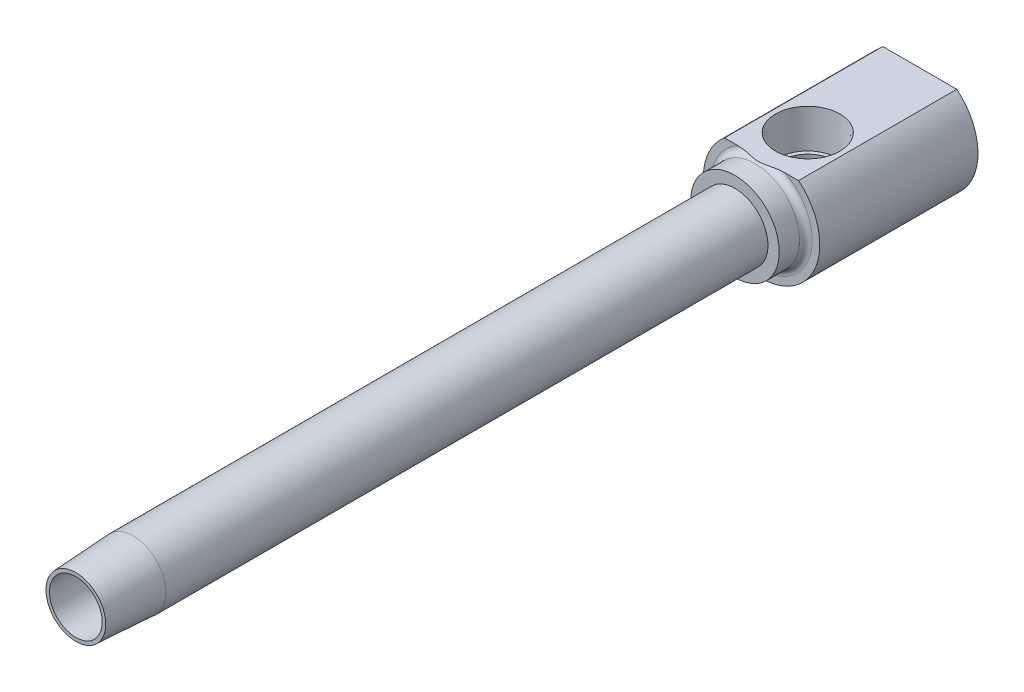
ISO-10303-21;
HEADER;
FILE_DESCRIPTION(('STEP AP214'),'2;1');
FILE_NAME('part.step','',(''),(''),'','','');
FILE_SCHEMA(('AUTOMOTIVE_DESIGN { 1 0 10303 214 1 1 1 1 }'));
ENDSEC;
DATA;
#1=APPLICATION_CONTEXT('core data for automotive mechanical design processes');
#2=APPLICATION_PROTOCOL_DEFINITION('international standard','automotive_design',2000,#1);
#3=PRODUCT_CONTEXT('',#1,'mechanical');
#4=PRODUCT('Part','Part','',(#3));
#5=PRODUCT_RELATED_PRODUCT_CATEGORY('part','',(#4));
#6=PRODUCT_DEFINITION_FORMATION('','',#4);
#7=PRODUCT_DEFINITION_CONTEXT('part definition',#1,'design');
#8=PRODUCT_DEFINITION('design','',#6,#7);
#9=PRODUCT_DEFINITION_SHAPE('','',#8);
#10=(LENGTH_UNIT() NAMED_UNIT(*) SI_UNIT(.MILLI.,.METRE.));
#11=(NAMED_UNIT(*) PLANE_ANGLE_UNIT() SI_UNIT($,.RADIAN.));
#12=(NAMED_UNIT(*) SI_UNIT($,.STERADIAN.) SOLID_ANGLE_UNIT());
#13=UNCERTAINTY_MEASURE_WITH_UNIT(LENGTH_MEASURE(1.E-05),#10,'distance_accuracy_value','');
#14=(GEOMETRIC_REPRESENTATION_CONTEXT(3) GLOBAL_UNCERTAINTY_ASSIGNED_CONTEXT((#13)) GLOBAL_UNIT_ASSIGNED_CONTEXT((#10,
#11,#12)) REPRESENTATION_CONTEXT('',''));
#15=CARTESIAN_POINT('',(0.,0.,0.));
#16=DIRECTION('',(0.,0.,1.));
#17=DIRECTION('',(1.,0.,0.));
#18=AXIS2_PLACEMENT_3D('',#15,#16,#17);
#19=CARTESIAN_POINT('',(0.,0.,-147.434766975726));
#20=DIRECTION('',(0.,0.,-1.));
#21=DIRECTION('',(-1.,0.,0.));
#22=AXIS2_PLACEMENT_3D('',#19,#20,#21);
#23=CYLINDRICAL_SURFACE('',#22,3.9751);
#24=CARTESIAN_POINT('',(0.,0.,-6.8834));
#25=DIRECTION('',(0.,0.,-1.));
#26=DIRECTION('',(-1.,0.,0.));
#27=AXIS2_PLACEMENT_3D('',#24,#25,#26);
#28=CIRCLE('',#27,3.9751);
#29=CARTESIAN_POINT('',(-3.9751,0.,-6.8834));
#30=VERTEX_POINT('',#29);
#31=EDGE_CURVE('E230',#30,#30,#28,.T.);
#32=ORIENTED_EDGE('',*,*,#31,.T.);
#33=EDGE_LOOP('',(#32));
#34=FACE_BOUND('',#33,.T.);
#35=CARTESIAN_POINT('',(0.,0.,-79.3496));
#36=DIRECTION('',(0.,0.,-1.));
#37=DIRECTION('',(-1.,0.,0.));
#38=AXIS2_PLACEMENT_3D('',#35,#36,#37);
#39=CIRCLE('',#38,3.9751);
#40=CARTESIAN_POINT('',(-3.9751,0.,-79.3496));
#41=VERTEX_POINT('',#40);
#42=EDGE_CURVE('E190',#41,#41,#39,.T.);
#43=ORIENTED_EDGE('',*,*,#42,.F.);
#44=EDGE_LOOP('',(#43));
#45=FACE_BOUND('',#44,.T.);
#46=ADVANCED_FACE('F15',(#34,#45),#23,.T.);
#47=CARTESIAN_POINT('',(-3.175,0.,-79.3496));
#48=DIRECTION('',(0.,0.,1.));
#49=DIRECTION('',(1.,0.,0.));
#50=AXIS2_PLACEMENT_3D('',#47,#48,#49);
#51=PLANE('',#50);
#52=CARTESIAN_POINT('',(0.,0.,-79.3496));
#53=DIRECTION('',(0.,0.,-1.));
#54=DIRECTION('',(-1.,0.,0.));
#55=AXIS2_PLACEMENT_3D('',#52,#53,#54);
#56=CIRCLE('',#55,3.175);
#57=CARTESIAN_POINT('',(-3.175,0.,-79.3496));
#58=VERTEX_POINT('',#57);
#59=EDGE_CURVE('E234',#58,#58,#56,.T.);
#60=ORIENTED_EDGE('',*,*,#59,.F.);
#61=EDGE_LOOP('',(#60));
#62=FACE_BOUND('',#61,.T.);
#63=CARTESIAN_POINT('',(0.,-0.206790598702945,-79.3496));
#64=DIRECTION('',(0.,0.,1.));
#65=DIRECTION('',(0.,1.,0.));
#66=AXIS2_PLACEMENT_3D('',#63,#64,#65);
#67=ELLIPSE('',#66,2.91070678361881,2.77750646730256);
#68=CARTESIAN_POINT('',(0.,2.70391618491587,-79.3496));
#69=VERTEX_POINT('',#68);
#70=EDGE_CURVE('E192',#69,#69,#67,.F.);
#71=ORIENTED_EDGE('',*,*,#70,.T.);
#72=EDGE_LOOP('',(#71));
#73=FACE_BOUND('',#72,.T.);
#74=ADVANCED_FACE('F211',(#62,#73),#51,.T.);
#75=CARTESIAN_POINT('',(-3.9751,0.,-79.3496));
#76=DIRECTION('',(0.,0.,1.));
#77=DIRECTION('',(1.,0.,0.));
#78=AXIS2_PLACEMENT_3D('',#75,#76,#77);
#79=PLANE('',#78);
#80=ORIENTED_EDGE('',*,*,#42,.T.);
#81=EDGE_LOOP('',(#80));
#82=FACE_BOUND('',#81,.T.);
#83=CARTESIAN_POINT('',(0.,0.,-79.3496));
#84=DIRECTION('',(0.,0.,-1.));
#85=DIRECTION('',(-1.,0.,0.));
#86=AXIS2_PLACEMENT_3D('',#83,#84,#85);
#87=CIRCLE('',#86,5.334);
#88=CARTESIAN_POINT('',(-5.334,0.,-79.3496));
#89=VERTEX_POINT('',#88);
#90=EDGE_CURVE('E252',#89,#89,#87,.T.);
#91=ORIENTED_EDGE('',*,*,#90,.F.);
#92=EDGE_LOOP('',(#91));
#93=FACE_BOUND('',#92,.T.);
#94=ADVANCED_FACE('F214',(#82,#93),#79,.T.);
#95=CARTESIAN_POINT('',(-3.175,0.,0.));
#96=DIRECTION('',(0.,0.,1.));
#97=DIRECTION('',(1.,0.,0.));
#98=AXIS2_PLACEMENT_3D('',#95,#96,#97);
#99=PLANE('',#98);
#100=CARTESIAN_POINT('',(0.,0.,0.));
#101=DIRECTION('',(0.,0.,-1.));
#102=DIRECTION('',(-1.,0.,0.));
#103=AXIS2_PLACEMENT_3D('',#100,#101,#102);
#104=CIRCLE('',#103,3.5941);
#105=CARTESIAN_POINT('',(-3.5941,0.,0.));
#106=VERTEX_POINT('',#105);
#107=EDGE_CURVE('E508',#106,#106,#104,.T.);
#108=ORIENTED_EDGE('',*,*,#107,.F.);
#109=EDGE_LOOP('',(#108));
#110=FACE_BOUND('',#109,.T.);
#111=CARTESIAN_POINT('',(0.,0.,0.));
#112=DIRECTION('',(0.,0.,-1.));
#113=DIRECTION('',(-1.,0.,0.));
#114=AXIS2_PLACEMENT_3D('',#111,#112,#113);
#115=CIRCLE('',#114,3.175);
#116=CARTESIAN_POINT('',(-3.175,0.,0.));
#117=VERTEX_POINT('',#116);
#118=EDGE_CURVE('E19',#117,#117,#115,.T.);
#119=ORIENTED_EDGE('',*,*,#118,.T.);
#120=EDGE_LOOP('',(#119));
#121=FACE_BOUND('',#120,.T.);
#122=ADVANCED_FACE('F17',(#110,#121),#99,.T.);
#123=CARTESIAN_POINT('',(0.,0.,-147.434766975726));
#124=DIRECTION('',(0.,0.,-1.));
#125=DIRECTION('',(-1.,0.,0.));
#126=AXIS2_PLACEMENT_3D('',#123,#124,#125);
#127=CYLINDRICAL_SURFACE('',#126,3.175);
#128=ORIENTED_EDGE('',*,*,#59,.T.);
#129=EDGE_LOOP('',(#128));
#130=FACE_BOUND('',#129,.T.);
#131=ORIENTED_EDGE('',*,*,#118,.F.);
#132=EDGE_LOOP('',(#131));
#133=FACE_BOUND('',#132,.T.);
#134=ADVANCED_FACE('F209',(#130,#133),#127,.F.);
#135=CARTESIAN_POINT('',(-7.0104,0.,-101.6));
#136=DIRECTION('',(0.,0.,-1.));
#137=DIRECTION('',(-1.,0.,0.));
#138=AXIS2_PLACEMENT_3D('',#135,#136,#137);
#139=PLANE('',#138);
#140=DIRECTION('',(1.,0.,0.));
#141=VECTOR('',#140,1.);
#142=CARTESIAN_POINT('',(-1.83308710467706,3.175,-101.6));
#143=LINE('',#142,#141);
#144=CARTESIAN_POINT('',(-1.83308710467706,3.175,-101.6));
#145=VERTEX_POINT('',#144);
#146=CARTESIAN_POINT('',(1.83308710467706,3.175,-101.6));
#147=VERTEX_POINT('',#146);
#148=EDGE_CURVE('E37',#145,#147,#143,.T.);
#149=ORIENTED_EDGE('',*,*,#148,.F.);
#150=DIRECTION('',(0.5,0.866025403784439,0.));
#151=VECTOR('',#150,1.);
#152=CARTESIAN_POINT('',(-3.66617420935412,0.,-101.6));
#153=LINE('',#152,#151);
#154=CARTESIAN_POINT('',(-3.66617420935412,0.,-101.6));
#155=VERTEX_POINT('',#154);
#156=EDGE_CURVE('E278',#155,#145,#153,.T.);
#157=ORIENTED_EDGE('',*,*,#156,.F.);
#158=DIRECTION('',(-0.5,0.866025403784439,0.));
#159=VECTOR('',#158,1.);
#160=CARTESIAN_POINT('',(-1.83308710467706,-3.175,-101.6));
#161=LINE('',#160,#159);
#162=CARTESIAN_POINT('',(-1.83308710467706,-3.175,-101.6));
#163=VERTEX_POINT('',#162);
#164=EDGE_CURVE('E282',#163,#155,#161,.T.);
#165=ORIENTED_EDGE('',*,*,#164,.F.);
#166=DIRECTION('',(-1.,0.,0.));
#167=VECTOR('',#166,1.);
#168=CARTESIAN_POINT('',(1.83308710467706,-3.175,-101.6));
#169=LINE('',#168,#167);
#170=CARTESIAN_POINT('',(1.83308710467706,-3.175,-101.6));
#171=VERTEX_POINT('',#170);
#172=EDGE_CURVE('E285',#171,#163,#169,.T.);
#173=ORIENTED_EDGE('',*,*,#172,.F.);
#174=DIRECTION('',(-0.5,-0.866025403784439,0.));
#175=VECTOR('',#174,1.);
#176=CARTESIAN_POINT('',(3.66617420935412,0.,-101.6));
#177=LINE('',#176,#175);
#178=CARTESIAN_POINT('',(3.66617420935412,0.,-101.6));
#179=VERTEX_POINT('',#178);
#180=EDGE_CURVE('E288',#179,#171,#177,.T.);
#181=ORIENTED_EDGE('',*,*,#180,.F.);
#182=DIRECTION('',(0.5,-0.866025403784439,0.));
#183=VECTOR('',#182,1.);
#184=CARTESIAN_POINT('',(1.83308710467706,3.175,-101.6));
#185=LINE('',#184,#183);
#186=EDGE_CURVE('E291',#147,#179,#185,.T.);
#187=ORIENTED_EDGE('',*,*,#186,.F.);
#188=EDGE_LOOP('',(#149,#157,#165,#173,#181,#187));
#189=FACE_BOUND('',#188,.T.);
#190=DIRECTION('',(-1.,0.,0.));
#191=VECTOR('',#190,1.);
#192=CARTESIAN_POINT('',(-4.4577,5.41060244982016,-101.6));
#193=LINE('',#192,#191);
#194=CARTESIAN_POINT('',(4.4577,5.41060244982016,-101.6));
#195=VERTEX_POINT('',#194);
#196=CARTESIAN_POINT('',(-4.4577,5.41060244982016,-101.6));
#197=VERTEX_POINT('',#196);
#198=EDGE_CURVE('E261',#195,#197,#193,.T.);
#199=ORIENTED_EDGE('',*,*,#198,.F.);
#200=CARTESIAN_POINT('',(0.,0.,-101.6));
#201=DIRECTION('',(0.,0.,-1.));
#202=DIRECTION('',(-1.,0.,0.));
#203=AXIS2_PLACEMENT_3D('',#200,#201,#202);
#204=CIRCLE('',#203,7.0104);
#205=EDGE_CURVE('E238',#195,#197,#204,.T.);
#206=ORIENTED_EDGE('',*,*,#205,.T.);
#207=EDGE_LOOP('',(#199,#206));
#208=FACE_BOUND('',#207,.T.);
#209=ADVANCED_FACE('F205',(#189,#208),#139,.T.);
#210=CARTESIAN_POINT('',(0.,0.,-147.434766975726));
#211=DIRECTION('',(0.,0.,-1.));
#212=DIRECTION('',(-1.,0.,0.));
#213=AXIS2_PLACEMENT_3D('',#210,#211,#212);
#214=CYLINDRICAL_SURFACE('',#213,7.0104);
#215=DIRECTION('',(0.,0.,-1.));
#216=VECTOR('',#215,1.);
#217=CARTESIAN_POINT('',(-4.4577,5.41060244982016,-72.2376));
#218=LINE('',#217,#216);
#219=CARTESIAN_POINT('',(-4.4577,5.41060244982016,-82.55));
#220=VERTEX_POINT('',#219);
#221=EDGE_CURVE('E258',#220,#197,#218,.T.);
#222=ORIENTED_EDGE('',*,*,#221,.T.);
#223=ORIENTED_EDGE('',*,*,#205,.F.);
#224=DIRECTION('',(0.,0.,-1.));
#225=VECTOR('',#224,1.);
#226=CARTESIAN_POINT('',(4.4577,5.41060244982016,-72.2376));
#227=LINE('',#226,#225);
#228=CARTESIAN_POINT('',(4.4577,5.41060244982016,-82.55));
#229=VERTEX_POINT('',#228);
#230=EDGE_CURVE('E259',#229,#195,#227,.T.);
#231=ORIENTED_EDGE('',*,*,#230,.F.);
#232=CARTESIAN_POINT('',(0.,0.,-82.55));
#233=DIRECTION('',(0.,0.,-1.));
#234=DIRECTION('',(-1.,0.,0.));
#235=AXIS2_PLACEMENT_3D('',#232,#233,#234);
#236=CIRCLE('',#235,7.0104);
#237=EDGE_CURVE('E241',#229,#220,#236,.T.);
#238=ORIENTED_EDGE('',*,*,#237,.T.);
#239=EDGE_LOOP('',(#222,#223,#231,#238));
#240=FACE_BOUND('',#239,.T.);
#241=ADVANCED_FACE('F201',(#240),#214,.T.);
#242=CARTESIAN_POINT('',(-6.096,0.,-82.55));
#243=DIRECTION('',(0.,0.,1.));
#244=DIRECTION('',(1.,0.,0.));
#245=AXIS2_PLACEMENT_3D('',#242,#243,#244);
#246=PLANE('',#245);
#247=DIRECTION('',(1.,0.,0.));
#248=VECTOR('',#247,1.);
#249=CARTESIAN_POINT('',(-6.096,5.41060244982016,-82.55));
#250=LINE('',#249,#248);
#251=CARTESIAN_POINT('',(-2.80830858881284,5.41060244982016,-82.55));
#252=VERTEX_POINT('',#251);
#253=EDGE_CURVE('E255',#220,#252,#250,.T.);
#254=ORIENTED_EDGE('',*,*,#253,.F.);
#255=ORIENTED_EDGE('',*,*,#237,.F.);
#256=CARTESIAN_POINT('',(2.80830858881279,5.41060244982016,-82.55));
#257=VERTEX_POINT('',#256);
#258=EDGE_CURVE('E256',#257,#229,#250,.T.);
#259=ORIENTED_EDGE('',*,*,#258,.F.);
#260=CARTESIAN_POINT('',(0.,0.,-82.55));
#261=DIRECTION('',(0.,0.,-1.));
#262=DIRECTION('',(-1.,0.,0.));
#263=AXIS2_PLACEMENT_3D('',#260,#261,#262);
#264=CIRCLE('',#263,6.096);
#265=EDGE_CURVE('E246',#257,#252,#264,.T.);
#266=ORIENTED_EDGE('',*,*,#265,.T.);
#267=EDGE_LOOP('',(#254,#255,#259,#266));
#268=FACE_BOUND('',#267,.T.);
#269=ADVANCED_FACE('F197',(#268),#246,.T.);
#270=CARTESIAN_POINT('',(0.,0.,-81.788));
#271=DIRECTION('',(0.,0.,-1.));
#272=DIRECTION('',(-1.,0.,0.));
#273=AXIS2_PLACEMENT_3D('',#270,#271,#272);
#274=TOROIDAL_SURFACE('',#273,6.096,0.762);
#275=CARTESIAN_POINT('',(0.,5.41060244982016,-82.1209777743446));
#276=CARTESIAN_POINT('',(0.0521470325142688,5.41060244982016,-82.1209662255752));
#277=CARTESIAN_POINT('',(0.104287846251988,5.41060244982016,-82.1225421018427));
#278=CARTESIAN_POINT('',(0.208401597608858,5.41060244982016,-82.1286316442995));
#279=CARTESIAN_POINT('',(0.260374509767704,5.41060244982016,-82.1331457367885));
#280=CARTESIAN_POINT('',(0.416241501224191,5.41060244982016,-82.1504483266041));
#281=CARTESIAN_POINT('',(0.519704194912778,5.41060244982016,-82.1669914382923));
#282=CARTESIAN_POINT('',(0.726918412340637,5.41060244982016,-82.2056198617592));
#283=CARTESIAN_POINT('',(0.830655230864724,5.41060244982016,-82.2277764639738));
#284=CARTESIAN_POINT('',(1.03759009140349,5.41060244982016,-82.2738404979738));
#285=CARTESIAN_POINT('',(1.14078865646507,5.41060244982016,-82.2977456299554));
#286=CARTESIAN_POINT('',(1.34834228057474,5.41060244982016,-82.3452053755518));
#287=CARTESIAN_POINT('',(1.4526986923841,5.41060244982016,-82.3687541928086));
#288=CARTESIAN_POINT('',(1.6619797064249,5.41060244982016,-82.413460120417));
#289=CARTESIAN_POINT('',(1.76690452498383,5.41060244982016,-82.4346162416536));
#290=CARTESIAN_POINT('',(1.97693672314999,5.41060244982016,-82.4728529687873));
#291=CARTESIAN_POINT('',(2.08204009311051,5.41060244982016,-82.4899548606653));
#292=CARTESIAN_POINT('',(2.29298648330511,5.41060244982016,-82.5186452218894));
#293=CARTESIAN_POINT('',(2.39882937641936,5.41060244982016,-82.5302346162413));
#294=CARTESIAN_POINT('',(2.63825679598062,5.41060244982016,-82.5481707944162));
#295=CARTESIAN_POINT('',(2.77203238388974,5.41060244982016,-82.5524268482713));
#296=CARTESIAN_POINT('',(2.97236053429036,5.41060244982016,-82.5467542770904));
#297=CARTESIAN_POINT('',(3.03908464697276,5.41060244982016,-82.5428533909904));
#298=CARTESIAN_POINT('',(3.17206397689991,5.41060244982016,-82.530250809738));
#299=CARTESIAN_POINT('',(3.2383194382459,5.41060244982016,-82.5215518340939));
#300=CARTESIAN_POINT('',(3.37725624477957,5.41060244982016,-82.49711512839));
#301=CARTESIAN_POINT('',(3.44982215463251,5.41060244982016,-82.48069575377));
#302=CARTESIAN_POINT('',(3.59245961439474,5.41060244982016,-82.4390714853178));
#303=CARTESIAN_POINT('',(3.66253326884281,5.41060244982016,-82.4138742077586));
#304=CARTESIAN_POINT('',(3.77900159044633,5.41060244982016,-82.3610231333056));
#305=CARTESIAN_POINT('',(3.82657256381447,5.41060244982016,-82.3359897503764));
#306=CARTESIAN_POINT('',(3.91754959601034,5.41060244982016,-82.279184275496));
#307=CARTESIAN_POINT('',(3.96096325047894,5.41060244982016,-82.2474248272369));
#308=CARTESIAN_POINT('',(4.02798010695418,5.41060244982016,-82.18789070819));
#309=CARTESIAN_POINT('',(4.05342428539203,5.41060244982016,-82.1621989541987));
#310=CARTESIAN_POINT('',(4.10009948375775,5.41060244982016,-82.1072158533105));
#311=CARTESIAN_POINT('',(4.12133630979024,5.41060244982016,-82.0779295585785));
#312=CARTESIAN_POINT('',(4.15466127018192,5.41060244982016,-82.0218876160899));
#313=CARTESIAN_POINT('',(4.16772173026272,5.41060244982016,-81.995714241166));
#314=CARTESIAN_POINT('',(4.18933719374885,5.41060244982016,-81.941556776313));
#315=CARTESIAN_POINT('',(4.19789541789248,5.41060244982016,-81.9135739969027));
#316=CARTESIAN_POINT('',(4.20987180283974,5.41060244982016,-81.8563342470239));
#317=CARTESIAN_POINT('',(4.21325884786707,5.41060244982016,-81.827070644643));
#318=CARTESIAN_POINT('',(4.21447858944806,5.41060244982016,-81.7684289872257));
#319=CARTESIAN_POINT('',(4.21231242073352,5.41060244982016,-81.7390509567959));
#320=CARTESIAN_POINT('',(4.20309810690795,5.41060244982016,-81.683964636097));
#321=CARTESIAN_POINT('',(4.19653350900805,5.41060244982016,-81.6581729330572));
#322=CARTESIAN_POINT('',(4.17948851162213,5.41060244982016,-81.6079301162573));
#323=CARTESIAN_POINT('',(4.16900680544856,5.41060244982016,-81.5834794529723));
#324=CARTESIAN_POINT('',(4.14035818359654,5.41060244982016,-81.5278520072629));
#325=CARTESIAN_POINT('',(4.12078333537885,5.41060244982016,-81.4974012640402));
#326=CARTESIAN_POINT('',(4.07697861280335,5.41060244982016,-81.4400600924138));
#327=CARTESIAN_POINT('',(4.05273917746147,5.41060244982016,-81.4131771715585));
#328=CARTESIAN_POINT('',(3.98868725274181,5.41060244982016,-81.3511561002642));
#329=CARTESIAN_POINT('',(3.94690497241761,5.41060244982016,-81.318064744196));
#330=CARTESIAN_POINT('',(3.8587952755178,5.41060244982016,-81.2586936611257));
#331=CARTESIAN_POINT('',(3.81245915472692,5.41060244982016,-81.2324273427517));
#332=CARTESIAN_POINT('',(3.7245267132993,5.41060244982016,-81.1894458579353));
#333=CARTESIAN_POINT('',(3.68333828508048,5.41060244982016,-81.1718773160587));
#334=CARTESIAN_POINT('',(3.59958587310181,5.41060244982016,-81.1403604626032));
#335=CARTESIAN_POINT('',(3.55702092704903,5.41060244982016,-81.1264147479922));
#336=CARTESIAN_POINT('',(3.42786902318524,5.41060244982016,-81.0892902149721));
#337=CARTESIAN_POINT('',(3.33991210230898,5.41060244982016,-81.070863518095));
#338=CARTESIAN_POINT('',(3.16528158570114,5.41060244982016,-81.0442403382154));
#339=CARTESIAN_POINT('',(3.07864723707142,5.41060244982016,-81.0357567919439));
#340=CARTESIAN_POINT('',(2.90489485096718,5.41060244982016,-81.0261313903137));
#341=CARTESIAN_POINT('',(2.8177763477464,5.41060244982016,-81.0249986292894));
#342=CARTESIAN_POINT('',(2.64327811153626,5.41060244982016,-81.0286504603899));
#343=CARTESIAN_POINT('',(2.55589913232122,5.41060244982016,-81.0334634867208));
#344=CARTESIAN_POINT('',(2.38166962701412,5.41060244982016,-81.0478649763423));
#345=CARTESIAN_POINT('',(2.29481855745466,5.41060244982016,-81.0574471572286));
#346=CARTESIAN_POINT('',(2.01384766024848,5.41060244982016,-81.0946709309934));
#347=CARTESIAN_POINT('',(1.82076533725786,5.41060244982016,-81.1299456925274));
#348=CARTESIAN_POINT('',(1.53229430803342,5.41060244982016,-81.1898846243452));
#349=CARTESIAN_POINT('',(1.43609183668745,5.41060244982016,-81.2110969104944));
#350=CARTESIAN_POINT('',(1.24390982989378,5.41060244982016,-81.2545341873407));
#351=CARTESIAN_POINT('',(1.14793028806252,5.41060244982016,-81.2767591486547));
#352=CARTESIAN_POINT('',(0.957697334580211,5.41060244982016,-81.3200933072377));
#353=CARTESIAN_POINT('',(0.863446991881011,5.41060244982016,-81.3412158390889));
#354=CARTESIAN_POINT('',(0.674290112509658,5.41060244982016,-81.3805444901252));
#355=CARTESIAN_POINT('',(0.579383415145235,5.41060244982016,-81.3987498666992));
#356=CARTESIAN_POINT('',(0.389272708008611,5.41060244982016,-81.4287534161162));
#357=CARTESIAN_POINT('',(0.294077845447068,5.41060244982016,-81.4406039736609));
#358=CARTESIAN_POINT('',(0.150791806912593,5.41060244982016,-81.4511395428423));
#359=CARTESIAN_POINT('',(0.102969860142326,5.41060244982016,-81.453445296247));
#360=CARTESIAN_POINT('',(0.00727423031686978,5.41060244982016,-81.4554444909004));
#361=CARTESIAN_POINT('',(-0.0405994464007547,5.41060244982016,-81.4551382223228));
#362=CARTESIAN_POINT('',(-0.136934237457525,5.41060244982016,-81.4519171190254));
#363=CARTESIAN_POINT('',(-0.185394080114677,5.41060244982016,-81.4489654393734));
#364=CARTESIAN_POINT('',(-0.282118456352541,5.41060244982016,-81.4406895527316));
#365=CARTESIAN_POINT('',(-0.330382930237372,5.41060244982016,-81.4353646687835));
#366=CARTESIAN_POINT('',(-0.475151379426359,5.41060244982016,-81.4164493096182));
#367=CARTESIAN_POINT('',(-0.571263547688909,5.41060244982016,-81.3999364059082));
#368=CARTESIAN_POINT('',(-0.764047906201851,5.41060244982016,-81.3625658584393));
#369=CARTESIAN_POINT('',(-0.860707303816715,5.41060244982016,-81.3416474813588));
#370=CARTESIAN_POINT('',(-1.05357295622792,5.41060244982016,-81.2984599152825));
#371=CARTESIAN_POINT('',(-1.1497796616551,5.41060244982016,-81.2761927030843));
#372=CARTESIAN_POINT('',(-1.36433899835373,5.41060244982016,-81.2271440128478));
#373=CARTESIAN_POINT('',(-1.48272280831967,5.41060244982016,-81.2004952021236));
#374=CARTESIAN_POINT('',(-1.72029970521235,5.41060244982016,-81.1505730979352));
#375=CARTESIAN_POINT('',(-1.83949323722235,5.41060244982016,-81.1273018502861));
#376=CARTESIAN_POINT('',(-2.07789765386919,5.41060244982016,-81.0865910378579));
#377=CARTESIAN_POINT('',(-2.19710038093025,5.41060244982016,-81.0691052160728));
#378=CARTESIAN_POINT('',(-2.43636519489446,5.41060244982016,-81.0420638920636));
#379=CARTESIAN_POINT('',(-2.55642644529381,5.41060244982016,-81.0325015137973));
#380=CARTESIAN_POINT('',(-2.76780194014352,5.41060244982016,-81.0251640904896));
#381=CARTESIAN_POINT('',(-2.85902659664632,5.41060244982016,-81.0250928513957));
#382=CARTESIAN_POINT('',(-3.04144991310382,5.41060244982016,-81.0327518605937));
#383=CARTESIAN_POINT('',(-3.13264774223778,5.41060244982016,-81.0405045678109));
#384=CARTESIAN_POINT('',(-3.31458996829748,5.41060244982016,-81.0660861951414));
#385=CARTESIAN_POINT('',(-3.40532344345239,5.41060244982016,-81.0840025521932));
#386=CARTESIAN_POINT('',(-3.53857286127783,5.41060244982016,-81.1206989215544));
#387=CARTESIAN_POINT('',(-3.58245316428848,5.41060244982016,-81.1345411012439));
#388=CARTESIAN_POINT('',(-3.6688305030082,5.41060244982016,-81.1659851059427));
#389=CARTESIAN_POINT('',(-3.71132868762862,5.41060244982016,-81.1835837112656));
#390=CARTESIAN_POINT('',(-3.79234387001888,5.41060244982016,-81.2221781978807));
#391=CARTESIAN_POINT('',(-3.83095410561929,5.41060244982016,-81.2429757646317));
#392=CARTESIAN_POINT('',(-3.90549335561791,5.41060244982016,-81.2890810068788));
#393=CARTESIAN_POINT('',(-3.94141935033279,5.41060244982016,-81.3143936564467));
#394=CARTESIAN_POINT('',(-4.00964525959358,5.41060244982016,-81.3703927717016));
#395=CARTESIAN_POINT('',(-4.04189445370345,5.41060244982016,-81.4011422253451));
#396=CARTESIAN_POINT('',(-4.10014383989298,5.41060244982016,-81.4680849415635));
#397=CARTESIAN_POINT('',(-4.12616464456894,5.41060244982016,-81.5042595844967));
#398=CARTESIAN_POINT('',(-4.16162371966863,5.41060244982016,-81.5677603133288));
#399=CARTESIAN_POINT('',(-4.17366550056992,5.41060244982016,-81.5936338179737));
#400=CARTESIAN_POINT('',(-4.19334521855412,5.41060244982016,-81.6470140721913));
#401=CARTESIAN_POINT('',(-4.20098675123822,5.41060244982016,-81.6745194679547));
#402=CARTESIAN_POINT('',(-4.21130602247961,5.41060244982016,-81.7306094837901));
#403=CARTESIAN_POINT('',(-4.21395773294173,5.41060244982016,-81.7591989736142));
#404=CARTESIAN_POINT('',(-4.21398264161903,5.41060244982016,-81.8163806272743));
#405=CARTESIAN_POINT('',(-4.21135613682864,5.41060244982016,-81.8449727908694));
#406=CARTESIAN_POINT('',(-4.20143815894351,5.41060244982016,-81.8991597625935));
#407=CARTESIAN_POINT('',(-4.1945008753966,5.41060244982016,-81.9248210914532));
#408=CARTESIAN_POINT('',(-4.17676949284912,5.41060244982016,-81.9747618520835));
#409=CARTESIAN_POINT('',(-4.1659739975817,5.41060244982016,-81.9990407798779));
#410=CARTESIAN_POINT('',(-4.13643456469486,5.41060244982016,-82.0546640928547));
#411=CARTESIAN_POINT('',(-4.11622825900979,5.41060244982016,-82.0852311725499));
#412=CARTESIAN_POINT('',(-4.0711573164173,5.41060244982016,-82.1427092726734));
#413=CARTESIAN_POINT('',(-4.04628281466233,5.41060244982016,-82.1696123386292));
#414=CARTESIAN_POINT('',(-3.98047143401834,5.41060244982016,-82.2317969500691));
#415=CARTESIAN_POINT('',(-3.93753463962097,5.41060244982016,-82.2649489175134));
#416=CARTESIAN_POINT('',(-3.84713170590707,5.41060244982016,-82.3242768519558));
#417=CARTESIAN_POINT('',(-3.79965701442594,5.41060244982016,-82.3504392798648));
#418=CARTESIAN_POINT('',(-3.70945527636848,5.41060244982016,-82.3932191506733));
#419=CARTESIAN_POINT('',(-3.66712202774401,5.41060244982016,-82.4106859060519));
#420=CARTESIAN_POINT('',(-3.58109351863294,5.41060244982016,-82.4419030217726));
#421=CARTESIAN_POINT('',(-3.53739729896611,5.41060244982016,-82.455650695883));
#422=CARTESIAN_POINT('',(-3.4048693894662,5.41060244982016,-82.4920695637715));
#423=CARTESIAN_POINT('',(-3.3146965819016,5.41060244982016,-82.5098735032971));
#424=CARTESIAN_POINT('',(-3.13512177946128,5.41060244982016,-82.5351720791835));
#425=CARTESIAN_POINT('',(-3.04574747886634,5.41060244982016,-82.5428878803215));
#426=CARTESIAN_POINT('',(-2.8665916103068,5.41060244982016,-82.5507574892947));
#427=CARTESIAN_POINT('',(-2.7768096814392,5.41060244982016,-82.5509021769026));
#428=CARTESIAN_POINT('',(-2.59707026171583,5.41060244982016,-82.5451298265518));
#429=CARTESIAN_POINT('',(-2.5071138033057,5.41060244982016,-82.5391854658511));
#430=CARTESIAN_POINT('',(-2.32777785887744,5.41060244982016,-82.5224498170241));
#431=CARTESIAN_POINT('',(-2.23839782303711,5.41060244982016,-82.5116641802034));
#432=CARTESIAN_POINT('',(-1.96748151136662,5.41060244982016,-82.4730986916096));
#433=CARTESIAN_POINT('',(-1.78682109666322,5.41060244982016,-82.4393132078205));
#434=CARTESIAN_POINT('',(-1.51682052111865,5.41060244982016,-82.3827135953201));
#435=CARTESIAN_POINT('',(-1.42679945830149,5.41060244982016,-82.3628126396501));
#436=CARTESIAN_POINT('',(-1.24695389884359,5.41060244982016,-82.3221437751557));
#437=CARTESIAN_POINT('',(-1.15712938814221,5.41060244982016,-82.3013759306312));
#438=CARTESIAN_POINT('',(-0.979057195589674,5.41060244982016,-82.2607394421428));
#439=CARTESIAN_POINT('',(-0.890811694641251,5.41060244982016,-82.240861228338));
#440=CARTESIAN_POINT('',(-0.713780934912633,5.41060244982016,-82.2034018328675));
#441=CARTESIAN_POINT('',(-0.624995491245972,5.41060244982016,-82.1858214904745));
#442=CARTESIAN_POINT('',(-0.447203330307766,5.41060244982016,-82.155660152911));
#443=CARTESIAN_POINT('',(-0.358203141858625,5.41060244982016,-82.1430430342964));
#444=CARTESIAN_POINT('',(-0.179461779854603,5.41060244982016,-82.1257167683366));
#445=CARTESIAN_POINT('',(-0.0897216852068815,5.41060244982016,-82.1209976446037));
#446=CARTESIAN_POINT('',(0.,5.41060244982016,-82.1209777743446));
#447=B_SPLINE_CURVE_WITH_KNOTS('',3,(#275,#276,#277,#278,#279,#280,#281,#282,#283,#284,#285,
#286,#287,#288,#289,#290,#291,#292,#293,#294,#295,#296,#297,#298,#299,#300,#301,#302,#303,#304,
#305,#306,#307,#308,#309,#310,#311,#312,#313,#314,#315,#316,#317,#318,#319,#320,#321,#322,#323,
#324,#325,#326,#327,#328,#329,#330,#331,#332,#333,#334,#335,#336,#337,#338,#339,#340,#341,#342,
#343,#344,#345,#346,#347,#348,#349,#350,#351,#352,#353,#354,#355,#356,#357,#358,#359,#360,#361,
#362,#363,#364,#365,#366,#367,#368,#369,#370,#371,#372,#373,#374,#375,#376,#377,#378,#379,#380,
#381,#382,#383,#384,#385,#386,#387,#388,#389,#390,#391,#392,#393,#394,#395,#396,#397,#398,#399,
#400,#401,#402,#403,#404,#405,#406,#407,#408,#409,#410,#411,#412,#413,#414,#415,#416,#417,#418,
#419,#420,#421,#422,#423,#424,#425,#426,#427,#428,#429,#430,#431,#432,#433,#434,#435,#436,#437,
#438,#439,#440,#441,#442,#443,#444,#445,#446),.UNSPECIFIED.,.T.,.F.,(4,2,2,2,2,2,2,2,2,2,2,2,2,
2,2,2,2,2,2,2,2,2,2,2,2,2,2,2,2,2,2,2,2,2,2,2,2,2,2,2,2,2,2,2,2,2,2,2,2,2,2,2,2,2,2,2,2,2,2,2,2,
2,2,2,2,2,2,2,2,2,2,2,2,2,2,2,2,2,2,2,2,2,2,2,2,4),(0.,0.156408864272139,0.312840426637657,
0.626836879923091,0.945040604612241,1.26283307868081,1.58376524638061,1.90482960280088,
2.22416896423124,2.54345472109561,2.9441659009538,3.14454518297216,3.34481100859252,
3.56760205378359,3.79020027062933,3.95104939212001,4.11159879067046,4.21974493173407,
4.32774077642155,4.41514397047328,4.50248455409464,4.5903486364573,4.67819476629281,
4.75769203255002,4.83721584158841,4.94521135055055,5.05343062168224,5.2124385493,
5.37175654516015,5.50590155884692,5.64014246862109,5.90890810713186,6.16970670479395,
6.43082789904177,6.69320268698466,6.95523275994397,7.54340798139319,7.8389677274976,
8.13451890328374,8.42427298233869,8.71410070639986,9.0015010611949,9.14506775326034,
9.28861849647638,9.43420020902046,9.57982347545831,9.87216797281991,10.1688428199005,
10.4650929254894,10.8291174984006,11.1933616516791,11.5546188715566,11.9155622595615,
12.1889721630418,12.4631691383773,12.7397615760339,12.8776619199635,13.0154445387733,
13.1467577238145,13.2782164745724,13.4113120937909,13.5439609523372,13.6292456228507,
13.7144605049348,13.8001186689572,13.8857720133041,13.965178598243,14.0446139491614,
14.1539273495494,14.2634744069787,14.4253063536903,14.5874495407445,14.7246386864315,
14.8619266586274,15.1368206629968,15.4055810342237,15.6746651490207,15.9449620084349,
16.2149441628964,16.7658370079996,17.0424344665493,17.319011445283,17.5903768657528,
17.8618411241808,18.131291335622,18.4004009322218),.UNSPECIFIED.);
#448=EDGE_CURVE('E105',#252,#257,#447,.T.);
#449=ORIENTED_EDGE('',*,*,#448,.F.);
#450=ORIENTED_EDGE('',*,*,#265,.F.);
#451=EDGE_LOOP('',(#449,#450));
#452=FACE_BOUND('',#451,.T.);
#453=CARTESIAN_POINT('',(0.,0.,-81.788));
#454=DIRECTION('',(0.,0.,-1.));
#455=DIRECTION('',(-1.,0.,0.));
#456=AXIS2_PLACEMENT_3D('',#453,#454,#455);
#457=CIRCLE('',#456,5.334);
#458=CARTESIAN_POINT('',(-5.334,0.,-81.788));
#459=VERTEX_POINT('',#458);
#460=EDGE_CURVE('E249',#459,#459,#457,.T.);
#461=ORIENTED_EDGE('',*,*,#460,.T.);
#462=EDGE_LOOP('',(#461));
#463=FACE_BOUND('',#462,.T.);
#464=ADVANCED_FACE('F193',(#452,#463),#274,.F.);
#465=CARTESIAN_POINT('',(0.,0.,-147.434766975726));
#466=DIRECTION('',(0.,0.,-1.));
#467=DIRECTION('',(-1.,0.,0.));
#468=AXIS2_PLACEMENT_3D('',#465,#466,#467);
#469=CYLINDRICAL_SURFACE('',#468,5.334);
#470=ORIENTED_EDGE('',*,*,#90,.T.);
#471=EDGE_LOOP('',(#470));
#472=FACE_BOUND('',#471,.T.);
#473=ORIENTED_EDGE('',*,*,#460,.F.);
#474=EDGE_LOOP('',(#473));
#475=FACE_BOUND('',#474,.T.);
#476=ADVANCED_FACE('F183',(#472,#475),#469,.T.);
#477=CARTESIAN_POINT('',(-4.4577,5.41060244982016,-72.2376));
#478=DIRECTION('',(0.,-1.,0.));
#479=DIRECTION('',(0.,0.,-1.));
#480=AXIS2_PLACEMENT_3D('',#477,#478,#479);
#481=PLANE('',#480);
#482=CARTESIAN_POINT('',(0.,5.41060244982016,-88.1126));
#483=DIRECTION('',(0.,-1.,0.));
#484=DIRECTION('',(0.,0.,-1.));
#485=AXIS2_PLACEMENT_3D('',#482,#483,#484);
#486=CIRCLE('',#485,3.8800785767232);
#487=CARTESIAN_POINT('',(0.,5.41060244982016,-91.9926785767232));
#488=VERTEX_POINT('',#487);
#489=EDGE_CURVE('E510',#488,#488,#486,.T.);
#490=ORIENTED_EDGE('',*,*,#489,.T.);
#491=EDGE_LOOP('',(#490));
#492=FACE_BOUND('',#491,.T.);
#493=ORIENTED_EDGE('',*,*,#253,.T.);
#494=ORIENTED_EDGE('',*,*,#448,.T.);
#495=ORIENTED_EDGE('',*,*,#258,.T.);
#496=ORIENTED_EDGE('',*,*,#230,.T.);
#497=ORIENTED_EDGE('',*,*,#198,.T.);
#498=ORIENTED_EDGE('',*,*,#221,.F.);
#499=EDGE_LOOP('',(#493,#494,#495,#496,#497,#498));
#500=FACE_BOUND('',#499,.T.);
#501=ADVANCED_FACE('F179',(#492,#500),#481,.F.);
#502=CARTESIAN_POINT('',(-1.83308710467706,3.175,-96.774));
#503=DIRECTION('',(0.,1.,0.));
#504=DIRECTION('',(-1.,0.,0.));
#505=AXIS2_PLACEMENT_3D('',#502,#503,#504);
#506=PLANE('',#505);
#507=ORIENTED_EDGE('',*,*,#148,.T.);
#508=DIRECTION('',(0.,0.,-1.));
#509=VECTOR('',#508,1.);
#510=CARTESIAN_POINT('',(1.83308710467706,3.175,-96.774));
#511=LINE('',#510,#509);
#512=CARTESIAN_POINT('',(1.83308710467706,3.175,-96.774));
#513=VERTEX_POINT('',#512);
#514=EDGE_CURVE('E266',#513,#147,#511,.T.);
#515=ORIENTED_EDGE('',*,*,#514,.F.);
#516=DIRECTION('',(1.,0.,0.));
#517=VECTOR('',#516,1.);
#518=CARTESIAN_POINT('',(-1.83308710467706,3.175,-96.774));
#519=LINE('',#518,#517);
#520=CARTESIAN_POINT('',(-1.83308710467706,3.175,-96.774));
#521=VERTEX_POINT('',#520);
#522=EDGE_CURVE('E281',#521,#513,#519,.T.);
#523=ORIENTED_EDGE('',*,*,#522,.F.);
#524=DIRECTION('',(0.,0.,-1.));
#525=VECTOR('',#524,1.);
#526=CARTESIAN_POINT('',(-1.83308710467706,3.175,-96.774));
#527=LINE('',#526,#525);
#528=EDGE_CURVE('E265',#521,#145,#527,.T.);
#529=ORIENTED_EDGE('',*,*,#528,.T.);
#530=EDGE_LOOP('',(#507,#515,#523,#529));
#531=FACE_BOUND('',#530,.T.);
#532=ADVANCED_FACE('F161',(#531),#506,.F.);
#533=CARTESIAN_POINT('',(-3.66617420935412,0.,-96.774));
#534=DIRECTION('',(-0.866025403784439,0.5,0.));
#535=DIRECTION('',(-0.5,-0.866025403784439,0.));
#536=AXIS2_PLACEMENT_3D('',#533,#534,#535);
#537=PLANE('',#536);
#538=ORIENTED_EDGE('',*,*,#156,.T.);
#539=ORIENTED_EDGE('',*,*,#528,.F.);
#540=DIRECTION('',(0.5,0.866025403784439,0.));
#541=VECTOR('',#540,1.);
#542=CARTESIAN_POINT('',(-3.66617420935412,0.,-96.774));
#543=LINE('',#542,#541);
#544=CARTESIAN_POINT('',(-3.66617420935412,0.,-96.774));
#545=VERTEX_POINT('',#544);
#546=EDGE_CURVE('E269',#545,#521,#543,.T.);
#547=ORIENTED_EDGE('',*,*,#546,.F.);
#548=DIRECTION('',(0.,0.,-1.));
#549=VECTOR('',#548,1.);
#550=CARTESIAN_POINT('',(-3.66617420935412,0.,-96.774));
#551=LINE('',#550,#549);
#552=EDGE_CURVE('E275',#545,#155,#551,.T.);
#553=ORIENTED_EDGE('',*,*,#552,.T.);
#554=EDGE_LOOP('',(#538,#539,#547,#553));
#555=FACE_BOUND('',#554,.T.);
#556=ADVANCED_FACE('F157',(#555),#537,.F.);
#557=CARTESIAN_POINT('',(-1.83308710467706,-3.175,-96.774));
#558=DIRECTION('',(-0.866025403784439,-0.5,0.));
#559=DIRECTION('',(0.5,-0.866025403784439,0.));
#560=AXIS2_PLACEMENT_3D('',#557,#558,#559);
#561=PLANE('',#560);
#562=ORIENTED_EDGE('',*,*,#164,.T.);
#563=ORIENTED_EDGE('',*,*,#552,.F.);
#564=DIRECTION('',(-0.5,0.866025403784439,0.));
#565=VECTOR('',#564,1.);
#566=CARTESIAN_POINT('',(-1.83308710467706,-3.175,-96.774));
#567=LINE('',#566,#565);
#568=CARTESIAN_POINT('',(-1.83308710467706,-3.175,-96.774));
#569=VERTEX_POINT('',#568);
#570=EDGE_CURVE('E297',#569,#545,#567,.T.);
#571=ORIENTED_EDGE('',*,*,#570,.F.);
#572=DIRECTION('',(0.,0.,-1.));
#573=VECTOR('',#572,1.);
#574=CARTESIAN_POINT('',(-1.83308710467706,-3.175,-96.774));
#575=LINE('',#574,#573);
#576=EDGE_CURVE('E273',#569,#163,#575,.T.);
#577=ORIENTED_EDGE('',*,*,#576,.T.);
#578=EDGE_LOOP('',(#562,#563,#571,#577));
#579=FACE_BOUND('',#578,.T.);
#580=ADVANCED_FACE('F160',(#579),#561,.F.);
#581=CARTESIAN_POINT('',(1.83308710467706,-3.175,-96.774));
#582=DIRECTION('',(0.,-1.,0.));
#583=DIRECTION('',(1.,0.,0.));
#584=AXIS2_PLACEMENT_3D('',#581,#582,#583);
#585=PLANE('',#584);
#586=ORIENTED_EDGE('',*,*,#172,.T.);
#587=ORIENTED_EDGE('',*,*,#576,.F.);
#588=DIRECTION('',(-1.,0.,0.));
#589=VECTOR('',#588,1.);
#590=CARTESIAN_POINT('',(1.83308710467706,-3.175,-96.774));
#591=LINE('',#590,#589);
#592=CARTESIAN_POINT('',(1.83308710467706,-3.175,-96.774));
#593=VERTEX_POINT('',#592);
#594=EDGE_CURVE('E300',#593,#569,#591,.T.);
#595=ORIENTED_EDGE('',*,*,#594,.F.);
#596=DIRECTION('',(0.,0.,-1.));
#597=VECTOR('',#596,1.);
#598=CARTESIAN_POINT('',(1.83308710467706,-3.175,-96.774));
#599=LINE('',#598,#597);
#600=EDGE_CURVE('E271',#593,#171,#599,.T.);
#601=ORIENTED_EDGE('',*,*,#600,.T.);
#602=EDGE_LOOP('',(#586,#587,#595,#601));
#603=FACE_BOUND('',#602,.T.);
#604=ADVANCED_FACE('F165',(#603),#585,.F.);
#605=CARTESIAN_POINT('',(3.66617420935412,0.,-96.774));
#606=DIRECTION('',(0.866025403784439,-0.5,0.));
#607=DIRECTION('',(0.5,0.866025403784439,0.));
#608=AXIS2_PLACEMENT_3D('',#605,#606,#607);
#609=PLANE('',#608);
#610=ORIENTED_EDGE('',*,*,#180,.T.);
#611=ORIENTED_EDGE('',*,*,#600,.F.);
#612=DIRECTION('',(-0.5,-0.866025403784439,0.));
#613=VECTOR('',#612,1.);
#614=CARTESIAN_POINT('',(3.66617420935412,0.,-96.774));
#615=LINE('',#614,#613);
#616=CARTESIAN_POINT('',(3.66617420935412,0.,-96.774));
#617=VERTEX_POINT('',#616);
#618=EDGE_CURVE('E303',#617,#593,#615,.T.);
#619=ORIENTED_EDGE('',*,*,#618,.F.);
#620=DIRECTION('',(0.,0.,-1.));
#621=VECTOR('',#620,1.);
#622=CARTESIAN_POINT('',(3.66617420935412,0.,-96.774));
#623=LINE('',#622,#621);
#624=EDGE_CURVE('E268',#617,#179,#623,.T.);
#625=ORIENTED_EDGE('',*,*,#624,.T.);
#626=EDGE_LOOP('',(#610,#611,#619,#625));
#627=FACE_BOUND('',#626,.T.);
#628=ADVANCED_FACE('F169',(#627),#609,.F.);
#629=CARTESIAN_POINT('',(1.83308710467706,3.175,-96.774));
#630=DIRECTION('',(0.866025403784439,0.5,0.));
#631=DIRECTION('',(-0.5,0.866025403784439,0.));
#632=AXIS2_PLACEMENT_3D('',#629,#630,#631);
#633=PLANE('',#632);
#634=ORIENTED_EDGE('',*,*,#186,.T.);
#635=ORIENTED_EDGE('',*,*,#624,.F.);
#636=DIRECTION('',(0.5,-0.866025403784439,0.));
#637=VECTOR('',#636,1.);
#638=CARTESIAN_POINT('',(1.83308710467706,3.175,-96.774));
#639=LINE('',#638,#637);
#640=EDGE_CURVE('E306',#513,#617,#639,.T.);
#641=ORIENTED_EDGE('',*,*,#640,.F.);
#642=ORIENTED_EDGE('',*,*,#514,.T.);
#643=EDGE_LOOP('',(#634,#635,#641,#642));
#644=FACE_BOUND('',#643,.T.);
#645=ADVANCED_FACE('F155',(#644),#633,.F.);
#646=CARTESIAN_POINT('',(0.,0.,-96.774));
#647=DIRECTION('',(0.,0.,-1.));
#648=DIRECTION('',(-1.,0.,0.));
#649=AXIS2_PLACEMENT_3D('',#646,#647,#648);
#650=PLANE('',#649);
#651=ORIENTED_EDGE('',*,*,#522,.T.);
#652=ORIENTED_EDGE('',*,*,#640,.T.);
#653=ORIENTED_EDGE('',*,*,#618,.T.);
#654=ORIENTED_EDGE('',*,*,#594,.T.);
#655=ORIENTED_EDGE('',*,*,#570,.T.);
#656=ORIENTED_EDGE('',*,*,#546,.T.);
#657=EDGE_LOOP('',(#651,#652,#653,#654,#655,#656));
#658=FACE_BOUND('',#657,.T.);
#659=ADVANCED_FACE('F151',(#658),#650,.T.);
#660=CARTESIAN_POINT('',(0.,-2.98624109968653,-88.0790554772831));
#661=DIRECTION('',(0.,0.298636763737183,0.954366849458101));
#662=DIRECTION('',(0.,-0.954366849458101,0.298636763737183));
#663=AXIS2_PLACEMENT_3D('',#660,#661,#662);
#664=CONICAL_SURFACE('',#663,2.29646041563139,0.826862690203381);
#665=CARTESIAN_POINT('',(-4.07250877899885,-2.19612830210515,-86.6020110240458));
#666=CARTESIAN_POINT('',(-3.92894564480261,-2.2961370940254,-86.7132886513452));
#667=CARTESIAN_POINT('',(-3.78492754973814,-2.39583064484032,-86.8242777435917));
#668=CARTESIAN_POINT('',(-3.49542612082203,-2.59418522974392,-87.0453997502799));
#669=CARTESIAN_POINT('',(-3.34994228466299,-2.69284588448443,-87.1555323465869));
#670=CARTESIAN_POINT('',(-3.05718484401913,-2.88857438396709,-87.3744858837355));
#671=CARTESIAN_POINT('',(-2.90991293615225,-2.98564356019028,-87.4833078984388));
#672=CARTESIAN_POINT('',(-2.61260725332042,-3.17745365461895,-87.699191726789));
#673=CARTESIAN_POINT('',(-2.46257392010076,-3.27219493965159,-87.8062538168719));
#674=CARTESIAN_POINT('',(-2.30585388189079,-3.36777676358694,-87.9152150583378));
#675=CARTESIAN_POINT('',(-2.30125812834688,-3.37057671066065,-87.9184077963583));
#676=CARTESIAN_POINT('',(-2.18325993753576,-3.44238980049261,-88.0003174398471));
#677=CARTESIAN_POINT('',(-2.06866761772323,-3.51030800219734,-88.0783122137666));
#678=CARTESIAN_POINT('',(-1.89428090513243,-3.60949921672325,-88.1938600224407));
#679=CARTESIAN_POINT('',(-1.83573157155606,-3.64211739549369,-88.2321377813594));
#680=CARTESIAN_POINT('',(-1.71764576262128,-3.70614874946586,-88.308162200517));
#681=CARTESIAN_POINT('',(-1.65810935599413,-3.73756200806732,-88.3459088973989));
#682=CARTESIAN_POINT('',(-1.50902814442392,-3.81348555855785,-88.4387975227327));
#683=CARTESIAN_POINT('',(-1.418779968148,-3.85705520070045,-88.493603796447));
#684=CARTESIAN_POINT('',(-1.28105412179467,-3.91788385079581,-88.5753076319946));
#685=CARTESIAN_POINT('',(-1.23473646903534,-3.93741186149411,-88.6024674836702));
#686=CARTESIAN_POINT('',(-1.14132702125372,-3.97432114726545,-88.6569030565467));
#687=CARTESIAN_POINT('',(-1.09423547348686,-3.99170309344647,-88.6841787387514));
#688=CARTESIAN_POINT('',(-0.997307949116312,-4.02406270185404,-88.7406998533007));
#689=CARTESIAN_POINT('',(-0.947443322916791,-4.03889834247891,-88.7699788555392));
#690=CARTESIAN_POINT('',(-0.847763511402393,-4.06317338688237,-88.8308955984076));
#691=CARTESIAN_POINT('',(-0.797948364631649,-4.07262087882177,-88.8625297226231));
#692=CARTESIAN_POINT('',(-0.715255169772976,-4.0812087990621,-88.9209697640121));
#693=CARTESIAN_POINT('',(-0.681720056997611,-4.08256924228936,-88.9464423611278));
#694=CARTESIAN_POINT('',(-0.617985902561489,-4.07965525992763,-89.0008455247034));
#695=CARTESIAN_POINT('',(-0.587772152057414,-4.07540686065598,-89.0297595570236));
#696=CARTESIAN_POINT('',(-0.532214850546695,-4.06142412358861,-89.0907430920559));
#697=CARTESIAN_POINT('',(-0.506873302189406,-4.05168753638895,-89.122813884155));
#698=CARTESIAN_POINT('',(-0.460853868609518,-4.02824244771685,-89.1889376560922));
#699=CARTESIAN_POINT('',(-0.440201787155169,-4.01451287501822,-89.223000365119));
#700=CARTESIAN_POINT('',(-0.402209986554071,-3.98452453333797,-89.2923272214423));
#701=CARTESIAN_POINT('',(-0.38490920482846,-3.96823960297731,-89.327600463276));
#702=CARTESIAN_POINT('',(-0.352569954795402,-3.93424634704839,-89.39851457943));
#703=CARTESIAN_POINT('',(-0.337533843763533,-3.91653656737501,-89.4341557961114));
#704=CARTESIAN_POINT('',(-0.294316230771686,-3.86219954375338,-89.5412152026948));
#705=CARTESIAN_POINT('',(-0.268029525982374,-3.82436859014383,-89.6127605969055));
#706=CARTESIAN_POINT('',(-0.231716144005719,-3.7724914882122,-89.7092207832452));
#707=CARTESIAN_POINT('',(-0.222113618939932,-3.75880866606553,-89.7345098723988));
#708=CARTESIAN_POINT('',(-0.202474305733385,-3.7314087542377,-89.7848944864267));
#709=CARTESIAN_POINT('',(-0.192437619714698,-3.71769167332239,-89.8099900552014));
#710=CARTESIAN_POINT('',(-0.16835287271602,-3.68618578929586,-89.8674096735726));
#711=CARTESIAN_POINT('',(-0.154009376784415,-3.66841964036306,-89.8996255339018));
#712=CARTESIAN_POINT('',(-0.127399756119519,-3.6394056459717,-89.9520439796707));
#713=CARTESIAN_POINT('',(-0.116086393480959,-3.62799604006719,-89.9726056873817));
#714=CARTESIAN_POINT('',(-0.0967960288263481,-3.61145924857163,-90.0023498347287));
#715=CARTESIAN_POINT('',(-0.089963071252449,-3.6060329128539,-90.0121000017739));
#716=CARTESIAN_POINT('',(-0.075088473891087,-3.59558512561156,-90.0308567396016));
#717=CARTESIAN_POINT('',(-0.067053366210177,-3.59056169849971,-90.0398669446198));
#718=CARTESIAN_POINT('',(-0.054899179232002,-3.58446020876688,-90.0508035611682));
#719=CARTESIAN_POINT('',(-0.0516862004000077,-3.58296263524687,-90.0534871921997));
#720=CARTESIAN_POINT('',(-0.0449596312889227,-3.5801284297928,-90.0585650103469));
#721=CARTESIAN_POINT('',(-0.0414456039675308,-3.57879203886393,-90.0609587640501));
#722=CARTESIAN_POINT('',(-0.0340308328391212,-3.57633948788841,-90.0653510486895));
#723=CARTESIAN_POINT('',(-0.0301255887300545,-3.57522647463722,-90.0673439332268));
#724=CARTESIAN_POINT('',(-0.0219697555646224,-3.5733599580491,-90.0706856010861));
#725=CARTESIAN_POINT('',(-0.0177205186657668,-3.57260512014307,-90.0720367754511));
#726=CARTESIAN_POINT('',(-0.0102473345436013,-3.57172497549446,-90.0736121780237));
#727=CARTESIAN_POINT('',(-0.00708274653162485,-3.5714806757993,-90.0740494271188));
#728=CARTESIAN_POINT('',(-0.000714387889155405,-3.57126182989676,-90.0744411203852));
#729=CARTESIAN_POINT('',(0.00248936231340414,-3.57128714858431,-90.0743958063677));
#730=CARTESIAN_POINT('',(0.00883226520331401,-3.57160403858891,-90.0738286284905));
#731=CARTESIAN_POINT('',(0.0119715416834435,-3.5718950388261,-90.0733077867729));
#732=CARTESIAN_POINT('',(0.0181194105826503,-3.57271024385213,-90.0718485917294));
#733=CARTESIAN_POINT('',(0.0211278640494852,-3.57323469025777,-90.070909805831));
#734=CARTESIAN_POINT('',(0.0286013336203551,-3.57481605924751,-90.0680787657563));
#735=CARTESIAN_POINT('',(0.0329459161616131,-3.57600690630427,-90.0659466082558));
#736=CARTESIAN_POINT('',(0.0412158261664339,-3.57869375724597,-90.0611348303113));
#737=CARTESIAN_POINT('',(0.0451398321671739,-3.58019068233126,-90.0584535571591));
#738=CARTESIAN_POINT('',(0.0583057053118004,-3.58579053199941,-90.0484204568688));
#739=CARTESIAN_POINT('',(0.0666020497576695,-3.59040705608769,-90.0401445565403));
#740=CARTESIAN_POINT('',(0.0818753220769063,-3.6001268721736,-90.0227053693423));
#741=CARTESIAN_POINT('',(0.0888422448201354,-3.60523345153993,-90.0135360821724));
#742=CARTESIAN_POINT('',(0.102190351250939,-3.61591467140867,-89.9943390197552));
#743=CARTESIAN_POINT('',(0.108534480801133,-3.6214999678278,-89.9842913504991));
#744=CARTESIAN_POINT('',(0.120595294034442,-3.63282028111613,-89.9639044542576));
#745=CARTESIAN_POINT('',(0.126311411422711,-3.6385554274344,-89.9535649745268));
#746=CARTESIAN_POINT('',(0.14282779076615,-3.65591792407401,-89.9222256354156));
#747=CARTESIAN_POINT('',(0.152966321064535,-3.66767616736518,-89.900951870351));
#748=CARTESIAN_POINT('',(0.172289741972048,-3.69132323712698,-89.8580415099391));
#749=CARTESIAN_POINT('',(0.181473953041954,-3.70321215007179,-89.8364046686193));
#750=CARTESIAN_POINT('',(0.199269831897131,-3.72700226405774,-89.7929513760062));
#751=CARTESIAN_POINT('',(0.207882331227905,-3.738903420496,-89.7711352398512));
#752=CARTESIAN_POINT('',(0.229463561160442,-3.76918524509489,-89.7153772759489));
#753=CARTESIAN_POINT('',(0.242231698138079,-3.78754086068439,-89.6813453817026));
#754=CARTESIAN_POINT('',(0.267799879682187,-3.82397965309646,-89.6131171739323));
#755=CARTESIAN_POINT('',(0.280599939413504,-3.84206264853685,-89.5789207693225));
#756=CARTESIAN_POINT('',(0.306854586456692,-3.87771318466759,-89.510503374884));
#757=CARTESIAN_POINT('',(0.320309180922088,-3.89528071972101,-89.4762823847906));
#758=CARTESIAN_POINT('',(0.348599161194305,-3.92953632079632,-89.4079841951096));
#759=CARTESIAN_POINT('',(0.363433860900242,-3.94622481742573,-89.3739069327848));
#760=CARTESIAN_POINT('',(0.398407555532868,-3.98114177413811,-89.2998037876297));
#761=CARTESIAN_POINT('',(0.419019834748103,-3.99907733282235,-89.2598532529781));
#762=CARTESIAN_POINT('',(0.465471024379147,-4.03107989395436,-89.1816205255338));
#763=CARTESIAN_POINT('',(0.491277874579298,-4.04516943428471,-89.1433297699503));
#764=CARTESIAN_POINT('',(0.545373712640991,-4.06542869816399,-89.0753756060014));
#765=CARTESIAN_POINT('',(0.572759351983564,-4.07245088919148,-89.0452665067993));
#766=CARTESIAN_POINT('',(0.631629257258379,-4.08093258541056,-88.9884082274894));
#767=CARTESIAN_POINT('',(0.663120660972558,-4.0823822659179,-88.9616650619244));
#768=CARTESIAN_POINT('',(0.726968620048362,-4.08040036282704,-88.9122632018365));
#769=CARTESIAN_POINT('',(0.759244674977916,-4.07715530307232,-88.8894865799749));
#770=CARTESIAN_POINT('',(0.824583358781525,-4.06724495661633,-88.8458389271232));
#771=CARTESIAN_POINT('',(0.85764741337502,-4.06057293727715,-88.8249717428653));
#772=CARTESIAN_POINT('',(0.957502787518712,-4.03678737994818,-88.763626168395));
#773=CARTESIAN_POINT('',(1.02438068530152,-4.01595713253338,-88.7247969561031));
#774=CARTESIAN_POINT('',(1.14424359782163,-3.97341603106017,-88.6551927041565));
#775=CARTESIAN_POINT('',(1.197488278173,-3.95259799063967,-88.6242691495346));
#776=CARTESIAN_POINT('',(1.30297042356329,-3.90857902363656,-88.5623826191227));
#777=CARTESIAN_POINT('',(1.35520787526,-3.88537806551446,-88.5314196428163));
#778=CARTESIAN_POINT('',(1.45878040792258,-3.8372795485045,-88.4691444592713));
#779=CARTESIAN_POINT('',(1.5101142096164,-3.81237979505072,-88.4378318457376));
#780=CARTESIAN_POINT('',(1.6119245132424,-3.76133809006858,-88.3748239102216));
#781=CARTESIAN_POINT('',(1.66240096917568,-3.73519607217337,-88.3431285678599));
#782=CARTESIAN_POINT('',(1.81237855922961,-3.65554268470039,-88.2476678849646));
#783=CARTESIAN_POINT('',(1.91076959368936,-3.60064013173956,-88.1833218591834));
#784=CARTESIAN_POINT('',(2.10527415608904,-3.48854629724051,-88.0533541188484));
#785=CARTESIAN_POINT('',(2.20138879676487,-3.43135617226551,-87.9877330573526));
#786=CARTESIAN_POINT('',(2.30778939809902,-3.3666018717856,-87.9138740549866));
#787=CARTESIAN_POINT('',(2.31890687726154,-3.35981809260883,-87.9061417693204));
#788=CARTESIAN_POINT('',(2.34111888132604,-3.3462298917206,-87.8906638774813));
#789=CARTESIAN_POINT('',(2.3522134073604,-3.33942547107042,-87.8829182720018));
#790=CARTESIAN_POINT('',(2.36329704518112,-3.33261086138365,-87.8751659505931));
#791=B_SPLINE_CURVE_WITH_KNOTS('',3,(#665,#666,#667,#668,#669,#670,#671,#672,#673,#674,#675,
#676,#677,#678,#679,#680,#681,#682,#683,#684,#685,#686,#687,#688,#689,#690,#691,#692,#693,#694,
#695,#696,#697,#698,#699,#700,#701,#702,#703,#704,#705,#706,#707,#708,#709,#710,#711,#712,#713,
#714,#715,#716,#717,#718,#719,#720,#721,#722,#723,#724,#725,#726,#727,#728,#729,#730,#731,#732,
#733,#734,#735,#736,#737,#738,#739,#740,#741,#742,#743,#744,#745,#746,#747,#748,#749,#750,#751,
#752,#753,#754,#755,#756,#757,#758,#759,#760,#761,#762,#763,#764,#765,#766,#767,#768,#769,#770,
#771,#772,#773,#774,#775,#776,#777,#778,#779,#780,#781,#782,#783,#784,#785,#786,#787,#788,#789,
#790),.UNSPECIFIED.,.F.,.F.,(4,2,2,2,2,2,2,2,2,2,2,2,2,2,2,2,2,2,2,2,2,2,2,2,2,2,2,2,2,2,2,2,2,
2,2,2,2,2,2,2,2,2,2,2,2,2,2,2,2,2,2,2,2,2,2,2,2,2,2,2,2,2,4),(0.,0.622067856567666,
1.2443566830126,1.86609517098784,2.48773504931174,2.50650707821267,2.96951057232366,
3.20104373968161,3.43256085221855,3.77506503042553,3.94643820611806,4.11775765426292,
4.29672726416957,4.47542751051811,4.60135076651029,4.72669175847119,4.85208416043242,
4.97815065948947,5.10560397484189,5.23318905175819,5.48838992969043,5.57933478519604,
5.670258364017,5.78866806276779,5.8668036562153,5.90602976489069,5.94504999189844,
5.95837186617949,5.97171341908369,5.98523144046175,5.998698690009,6.00826669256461,
6.01782990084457,6.02737260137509,6.03692520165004,6.0517903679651,6.06670095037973,
6.10419109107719,6.14195312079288,6.181306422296,6.22069492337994,6.29965579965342,
6.37867252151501,6.45757167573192,6.57972991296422,6.70196612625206,6.82420367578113,
6.94638077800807,7.0913345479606,7.23541969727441,7.35860022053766,7.48199781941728,
7.60062536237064,7.7194868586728,7.95928812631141,8.15425409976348,8.34922265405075,
8.544448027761,8.73968384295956,9.12886253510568,9.51784689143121,9.5632853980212,
9.60872160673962),.UNSPECIFIED.);
#792=CARTESIAN_POINT('',(-2.25549871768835,-3.39834193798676,-87.9501024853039));
#793=VERTEX_POINT('',#792);
#794=CARTESIAN_POINT('',(2.25549871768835,-3.39834193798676,-87.9501024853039));
#795=VERTEX_POINT('',#794);
#796=EDGE_CURVE('E110',#793,#795,#791,.T.);
#797=ORIENTED_EDGE('',*,*,#796,.F.);
#798=CARTESIAN_POINT('',(0.,-2.98624109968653,-88.0790554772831));
#799=DIRECTION('',(0.,-0.298636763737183,-0.954366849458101));
#800=DIRECTION('',(0.,0.954366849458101,-0.298636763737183));
#801=AXIS2_PLACEMENT_3D('',#798,#799,#800);
#802=CIRCLE('',#801,2.29646041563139);
#803=EDGE_CURVE('E117',#795,#793,#802,.T.);
#804=ORIENTED_EDGE('',*,*,#803,.F.);
#805=EDGE_LOOP('',(#797,#804));
#806=FACE_BOUND('',#805,.T.);
#807=CARTESIAN_POINT('',(0.,-3.61740950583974,-90.0961085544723));
#808=VERTEX_POINT('',#807);
#809=VERTEX_LOOP('',#808);
#810=FACE_BOUND('',#809,.T.);
#811=ADVANCED_FACE('F147',(#806,#810),#664,.F.);
#812=CARTESIAN_POINT('',(0.,0.10005952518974,-78.2160266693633));
#813=DIRECTION('',(0.,0.298636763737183,0.954366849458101));
#814=DIRECTION('',(0.,-0.954366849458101,0.298636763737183));
#815=AXIS2_PLACEMENT_3D('',#812,#813,#814);
#816=CONICAL_SURFACE('',#815,2.83954893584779,0.0525020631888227);
#817=CARTESIAN_POINT('',(2.25182818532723,-3.35036202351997,-88.7650629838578));
#818=CARTESIAN_POINT('',(2.25288853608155,-3.35830343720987,-88.7119814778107));
#819=CARTESIAN_POINT('',(2.25364641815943,-3.36545931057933,-88.6587778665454));
#820=CARTESIAN_POINT('',(2.25472371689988,-3.37800256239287,-88.5521443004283));
#821=CARTESIAN_POINT('',(2.25504301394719,-3.38338945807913,-88.4987142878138));
#822=CARTESIAN_POINT('',(2.2555924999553,-3.39659879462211,-88.3381022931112));
#823=CARTESIAN_POINT('',(2.25541356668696,-3.4014616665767,-88.2306507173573));
#824=CARTESIAN_POINT('',(2.25532962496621,-3.40208473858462,-88.0179221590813));
#825=CARTESIAN_POINT('',(2.25541905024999,-3.3980303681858,-87.9126459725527));
#826=CARTESIAN_POINT('',(2.25685593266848,-3.38099709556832,-87.7029202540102));
#827=CARTESIAN_POINT('',(2.25820234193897,-3.36802562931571,-87.5984701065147));
#828=CARTESIAN_POINT('',(2.26317892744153,-3.32968516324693,-87.3647982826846));
#829=CARTESIAN_POINT('',(2.26729922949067,-3.302015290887,-87.2359692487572));
#830=CARTESIAN_POINT('',(2.27808749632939,-3.23678674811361,-86.980764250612));
#831=CARTESIAN_POINT('',(2.2847606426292,-3.1992080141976,-86.854393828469));
#832=CARTESIAN_POINT('',(2.30013752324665,-3.11589214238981,-86.6005706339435));
#833=CARTESIAN_POINT('',(2.30889330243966,-3.06995449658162,-86.4731881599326));
#834=CARTESIAN_POINT('',(2.32285889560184,-2.99733775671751,-86.2839644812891));
#835=CARTESIAN_POINT('',(2.32764087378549,-2.9725746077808,-86.221339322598));
#836=CARTESIAN_POINT('',(2.33740882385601,-2.92198880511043,-86.0965513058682));
#837=CARTESIAN_POINT('',(2.34239474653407,-2.89616640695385,-86.0343883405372));
#838=CARTESIAN_POINT('',(2.347444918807,-2.86990957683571,-85.9724144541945));
#839=B_SPLINE_CURVE_WITH_KNOTS('',3,(#817,#818,#819,#820,#821,#822,#823,#824,#825,#826,#827,
#828,#829,#830,#831,#832,#833,#834,#835,#836,#837,#838),.UNSPECIFIED.,.F.,.F.,(4,2,2,2,2,2,2,2,
2,2,4),(0.,0.161036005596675,0.322115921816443,0.644434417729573,0.960113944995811,
1.27553054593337,1.67045549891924,2.06618632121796,2.47309805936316,2.67563006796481,
2.87811349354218),.UNSPECIFIED.);
#840=CARTESIAN_POINT('',(2.34740644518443,-2.87010957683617,-85.9728864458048));
#841=VERTEX_POINT('',#840);
#842=EDGE_CURVE('E10',#795,#841,#839,.T.);
#843=ORIENTED_EDGE('',*,*,#842,.F.);
#844=ORIENTED_EDGE('',*,*,#803,.T.);
#845=CARTESIAN_POINT('',(-2.347444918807,-2.86990957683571,-85.9724144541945));
#846=CARTESIAN_POINT('',(-2.34073943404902,-2.90477830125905,-86.05475602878));
#847=CARTESIAN_POINT('',(-2.33414026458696,-2.93890888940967,-86.1374345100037));
#848=CARTESIAN_POINT('',(-2.32134513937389,-3.00519305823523,-86.3036788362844));
#849=CARTESIAN_POINT('',(-2.31514948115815,-3.03734517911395,-86.3872452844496));
#850=CARTESIAN_POINT('',(-2.303305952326,-3.09941465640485,-86.5561632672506));
#851=CARTESIAN_POINT('',(-2.29766388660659,-3.12930770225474,-86.6415242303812));
#852=CARTESIAN_POINT('',(-2.28723787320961,-3.18577335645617,-86.8133838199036));
#853=CARTESIAN_POINT('',(-2.28245377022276,-3.21234656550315,-86.8998822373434));
#854=CARTESIAN_POINT('',(-2.27414278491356,-3.26035165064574,-87.0707761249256));
#855=CARTESIAN_POINT('',(-2.27057462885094,-3.2819419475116,-87.1551245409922));
#856=CARTESIAN_POINT('',(-2.26460266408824,-3.32036680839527,-87.3249343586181));
#857=CARTESIAN_POINT('',(-2.26219858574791,-3.33720247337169,-87.4103954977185));
#858=CARTESIAN_POINT('',(-2.25856439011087,-3.36527251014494,-87.5819120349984));
#859=CARTESIAN_POINT('',(-2.25732953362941,-3.37652940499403,-87.6679635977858));
#860=CARTESIAN_POINT('',(-2.2557877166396,-3.39303892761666,-87.8406341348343));
#861=CARTESIAN_POINT('',(-2.25548050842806,-3.39829315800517,-87.9272529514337));
#862=CARTESIAN_POINT('',(-2.25532788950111,-3.40214505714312,-88.0762888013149));
#863=CARTESIAN_POINT('',(-2.25537704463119,-3.40219739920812,-88.138673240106));
#864=CARTESIAN_POINT('',(-2.25545627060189,-3.39932986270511,-88.2634199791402));
#865=CARTESIAN_POINT('',(-2.25548632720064,-3.39640777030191,-88.3257822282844));
#866=CARTESIAN_POINT('',(-2.25525889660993,-3.38776149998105,-88.4511738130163));
#867=CARTESIAN_POINT('',(-2.25499742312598,-3.3819990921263,-88.5142004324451));
#868=CARTESIAN_POINT('',(-2.25390645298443,-3.36797501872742,-88.6398996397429));
#869=CARTESIAN_POINT('',(-2.25307759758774,-3.35971618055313,-88.7025725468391));
#870=CARTESIAN_POINT('',(-2.25182818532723,-3.35036202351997,-88.7650629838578));
#871=B_SPLINE_CURVE_WITH_KNOTS('',3,(#845,#846,#847,#848,#849,#850,#851,#852,#853,#854,#855,
#856,#857,#858,#859,#860,#861,#862,#863,#864,#865,#866,#867,#868,#869,#870),.UNSPECIFIED.,.F.,
.F.,(4,2,2,2,2,2,2,2,2,2,2,2,4),(0.,0.269031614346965,0.538259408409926,0.810061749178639,
1.08181483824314,1.34311705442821,1.60435871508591,1.86453689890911,2.1246456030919,
2.31172983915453,2.49895342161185,2.68876878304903,2.87836996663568),.UNSPECIFIED.);
#872=CARTESIAN_POINT('',(-2.34740644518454,-2.87010957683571,-85.9728864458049));
#873=VERTEX_POINT('',#872);
#874=EDGE_CURVE('E24',#873,#793,#871,.T.);
#875=ORIENTED_EDGE('',*,*,#874,.F.);
#876=CARTESIAN_POINT('',(2.34736035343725,-2.87030957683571,-85.9728358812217));
#877=CARTESIAN_POINT('',(2.35935096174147,-2.81836861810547,-85.9860079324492));
#878=CARTESIAN_POINT('',(2.36955576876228,-2.76556742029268,-85.9974077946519));
#879=CARTESIAN_POINT('',(2.38643778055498,-2.65879148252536,-86.0164634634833));
#880=CARTESIAN_POINT('',(2.39311826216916,-2.6048178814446,-86.0241227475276));
#881=CARTESIAN_POINT('',(2.40295103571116,-2.49687797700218,-86.0354459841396));
#882=CARTESIAN_POINT('',(2.40614967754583,-2.44292138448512,-86.0391624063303));
#883=CARTESIAN_POINT('',(2.40933042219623,-2.33479615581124,-86.0428605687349));
#884=CARTESIAN_POINT('',(2.40931213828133,-2.28062749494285,-86.0428418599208));
#885=CARTESIAN_POINT('',(2.4047310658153,-2.11885558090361,-86.0375079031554));
#886=CARTESIAN_POINT('',(2.39568105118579,-2.01151554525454,-86.0269603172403));
#887=CARTESIAN_POINT('',(2.36727614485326,-1.79968302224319,-85.9947883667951));
#888=CARTESIAN_POINT('',(2.34788097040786,-1.69520335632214,-85.9731207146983));
#889=CARTESIAN_POINT('',(2.30360144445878,-1.50514867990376,-85.9255909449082));
#890=CARTESIAN_POINT('',(2.27991010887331,-1.41901828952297,-85.9007825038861));
#891=CARTESIAN_POINT('',(2.22649703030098,-1.24993829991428,-85.8470232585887));
#892=CARTESIAN_POINT('',(2.19677131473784,-1.16699083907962,-85.8180697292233));
#893=CARTESIAN_POINT('',(2.13148440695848,-1.00421560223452,-85.757295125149));
#894=CARTESIAN_POINT('',(2.09590648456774,-0.924397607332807,-85.7254659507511));
#895=CARTESIAN_POINT('',(2.01906267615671,-0.768301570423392,-85.6601273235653));
#896=CARTESIAN_POINT('',(1.97779813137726,-0.692022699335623,-85.6266182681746));
#897=CARTESIAN_POINT('',(1.88746165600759,-0.539809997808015,-85.5572984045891));
#898=CARTESIAN_POINT('',(1.83811906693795,-0.464051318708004,-85.5214523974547));
#899=CARTESIAN_POINT('',(1.73292194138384,-0.317139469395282,-85.4499460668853));
#900=CARTESIAN_POINT('',(1.67706538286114,-0.245987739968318,-85.4142858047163));
#901=CARTESIAN_POINT('',(1.49966241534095,-0.040955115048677,-85.3092947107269));
#902=CARTESIAN_POINT('',(1.36777414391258,0.0853857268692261,-85.2415362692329));
#903=CARTESIAN_POINT('',(1.13793556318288,0.259841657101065,-85.1457866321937));
#904=CARTESIAN_POINT('',(1.04966554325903,0.318276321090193,-85.1131979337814));
#905=CARTESIAN_POINT('',(0.863843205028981,0.422505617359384,-85.0545068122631));
#906=CARTESIAN_POINT('',(0.766295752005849,0.468306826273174,-85.0284010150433));
#907=CARTESIAN_POINT('',(0.562109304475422,0.54453261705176,-84.9847055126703));
#908=CARTESIAN_POINT('',(0.455379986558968,0.574777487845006,-84.9672154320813));
#909=CARTESIAN_POINT('',(0.237083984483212,0.616054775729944,-84.9432986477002));
#910=CARTESIAN_POINT('',(0.12552453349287,0.62711496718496,-84.9368559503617));
#911=CARTESIAN_POINT('',(-0.081095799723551,0.628689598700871,-84.9359386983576));
#912=CARTESIAN_POINT('',(-0.176140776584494,0.622017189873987,-84.9398254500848));
#913=CARTESIAN_POINT('',(-0.363442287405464,0.594503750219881,-84.9557920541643));
#914=CARTESIAN_POINT('',(-0.455697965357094,0.573658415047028,-84.9678743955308));
#915=CARTESIAN_POINT('',(-0.632689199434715,0.520120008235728,-84.9987169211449));
#916=CARTESIAN_POINT('',(-0.717559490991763,0.487756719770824,-85.0172909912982));
#917=CARTESIAN_POINT('',(-0.881231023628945,0.412984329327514,-85.0598496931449));
#918=CARTESIAN_POINT('',(-0.96003064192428,0.370572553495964,-85.0838357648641));
#919=CARTESIAN_POINT('',(-1.15620941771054,0.249640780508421,-85.151491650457));
#920=CARTESIAN_POINT('',(-1.26851788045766,0.164684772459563,-85.1983609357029));
#921=CARTESIAN_POINT('',(-1.47664976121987,-0.0207858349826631,-85.2980678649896));
#922=CARTESIAN_POINT('',(-1.57241648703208,-0.121351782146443,-85.3509250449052));
#923=CARTESIAN_POINT('',(-1.72107321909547,-0.301360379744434,-85.4420824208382));
#924=CARTESIAN_POINT('',(-1.77807680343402,-0.377749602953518,-85.4798434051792));
#925=CARTESIAN_POINT('',(-1.88493793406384,-0.53548907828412,-85.5552614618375));
#926=CARTESIAN_POINT('',(-1.93479175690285,-0.616841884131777,-85.592918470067));
#927=CARTESIAN_POINT('',(-2.02752677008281,-0.783988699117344,-85.6669218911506));
#928=CARTESIAN_POINT('',(-2.07040808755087,-0.8697826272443,-85.7032683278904));
#929=CARTESIAN_POINT('',(-2.14920097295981,-1.04550024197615,-85.7732830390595));
#930=CARTESIAN_POINT('',(-2.18511626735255,-1.13542168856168,-85.8069527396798));
#931=CARTESIAN_POINT('',(-2.25970868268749,-1.34748044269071,-85.8796923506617));
#932=CARTESIAN_POINT('',(-2.29586336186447,-1.47105045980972,-85.9172583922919));
#933=CARTESIAN_POINT('',(-2.35444364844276,-1.72428944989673,-85.9801928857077));
#934=CARTESIAN_POINT('',(-2.37690771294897,-1.85394022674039,-86.0055954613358));
#935=CARTESIAN_POINT('',(-2.40214898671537,-2.08660166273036,-86.0344635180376));
#936=CARTESIAN_POINT('',(-2.40830070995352,-2.18875498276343,-86.0416689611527));
#937=CARTESIAN_POINT('',(-2.40946497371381,-2.3931911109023,-86.0430119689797));
#938=CARTESIAN_POINT('',(-2.404500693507,-2.49547320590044,-86.0371767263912));
#939=CARTESIAN_POINT('',(-2.38840239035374,-2.6426894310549,-86.0187353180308));
#940=CARTESIAN_POINT('',(-2.38201974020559,-2.6888939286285,-86.011455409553));
#941=CARTESIAN_POINT('',(-2.36664917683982,-2.78037193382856,-85.9941583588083));
#942=CARTESIAN_POINT('',(-2.35765999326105,-2.82564497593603,-85.9841398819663));
#943=CARTESIAN_POINT('',(-2.34736035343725,-2.87030957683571,-85.9728358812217));
#944=B_SPLINE_CURVE_WITH_KNOTS('',3,(#876,#877,#878,#879,#880,#881,#882,#883,#884,#885,#886,
#887,#888,#889,#890,#891,#892,#893,#894,#895,#896,#897,#898,#899,#900,#901,#902,#903,#904,#905,
#906,#907,#908,#909,#910,#911,#912,#913,#914,#915,#916,#917,#918,#919,#920,#921,#922,#923,#924,
#925,#926,#927,#928,#929,#930,#931,#932,#933,#934,#935,#936,#937,#938,#939,#940,#941,#942,#943),
.UNSPECIFIED.,.F.,.F.,(4,2,2,2,2,2,2,2,2,2,2,2,2,2,2,2,2,2,2,2,2,2,2,2,2,2,2,2,2,2,2,2,2,4),(0.,
0.16466611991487,0.329178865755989,0.491473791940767,0.653788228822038,0.9770130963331,
1.30150584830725,1.57926003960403,1.8571976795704,2.13594415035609,2.4146249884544,
2.70604440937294,2.99755453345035,3.5773091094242,3.90859191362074,4.23970193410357,
4.57455565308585,4.90892418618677,5.1935225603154,5.47820740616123,5.75532218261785,
6.03251078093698,6.47526975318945,6.91951728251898,7.22672664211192,7.53409541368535,
7.84145858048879,8.14865686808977,8.54993126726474,8.9500732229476,9.25667646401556,
9.56264096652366,9.70412496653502,9.84567803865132),.UNSPECIFIED.);
#945=EDGE_CURVE('E99',#841,#873,#944,.T.);
#946=ORIENTED_EDGE('',*,*,#945,.F.);
#947=EDGE_LOOP('',(#843,#844,#875,#946));
#948=FACE_BOUND('',#947,.T.);
#949=ORIENTED_EDGE('',*,*,#70,.F.);
#950=EDGE_LOOP('',(#949));
#951=FACE_BOUND('',#950,.T.);
#952=ADVANCED_FACE('F114',(#948,#951),#816,.F.);
#953=CARTESIAN_POINT('',(0.,-4.70392991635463,-88.1126));
#954=DIRECTION('',(0.,1.,0.));
#955=DIRECTION('',(0.,0.,1.));
#956=AXIS2_PLACEMENT_3D('',#953,#954,#955);
#957=CONICAL_SURFACE('',#956,0.,1.0471975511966);
#958=ORIENTED_EDGE('',*,*,#842,.T.);
#959=CARTESIAN_POINT('',(0.,-2.87010957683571,-88.1126));
#960=DIRECTION('',(0.,-1.,0.));
#961=DIRECTION('',(0.,0.,-1.));
#962=AXIS2_PLACEMENT_3D('',#959,#960,#961);
#963=CIRCLE('',#962,3.17627);
#964=EDGE_CURVE('E30',#873,#841,#963,.T.);
#965=ORIENTED_EDGE('',*,*,#964,.F.);
#966=ORIENTED_EDGE('',*,*,#874,.T.);
#967=ORIENTED_EDGE('',*,*,#796,.T.);
#968=EDGE_LOOP('',(#958,#965,#966,#967));
#969=FACE_BOUND('',#968,.T.);
#970=ADVANCED_FACE('F108',(#969),#957,.F.);
#971=CARTESIAN_POINT('',(0.,5.41060244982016,-88.1126));
#972=DIRECTION('',(0.,-1.,0.));
#973=DIRECTION('',(0.,0.,-1.));
#974=AXIS2_PLACEMENT_3D('',#971,#972,#973);
#975=CYLINDRICAL_SURFACE('',#974,3.17627);
#976=ORIENTED_EDGE('',*,*,#945,.T.);
#977=ORIENTED_EDGE('',*,*,#964,.T.);
#978=EDGE_LOOP('',(#976,#977));
#979=FACE_BOUND('',#978,.T.);
#980=CARTESIAN_POINT('',(0.,0.915609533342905,-88.1126));
#981=DIRECTION('',(0.,-1.,0.));
#982=DIRECTION('',(0.,0.,-1.));
#983=AXIS2_PLACEMENT_3D('',#980,#981,#982);
#984=CIRCLE('',#983,3.17627);
#985=CARTESIAN_POINT('',(0.,0.915609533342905,-91.28887));
#986=VERTEX_POINT('',#985);
#987=EDGE_CURVE('E111',#986,#986,#984,.T.);
#988=ORIENTED_EDGE('',*,*,#987,.F.);
#989=EDGE_LOOP('',(#988));
#990=FACE_BOUND('',#989,.T.);
#991=ADVANCED_FACE('F100',(#979,#990),#975,.F.);
#992=CARTESIAN_POINT('',(0.,0.915609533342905,-91.7566897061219));
#993=DIRECTION('',(0.,-1.,0.));
#994=DIRECTION('',(0.,0.,-1.));
#995=AXIS2_PLACEMENT_3D('',#992,#993,#994);
#996=PLANE('',#995);
#997=CARTESIAN_POINT('',(0.,0.915609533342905,-88.1126));
#998=DIRECTION('',(0.,-1.,0.));
#999=DIRECTION('',(0.,0.,-1.));
#1000=AXIS2_PLACEMENT_3D('',#997,#998,#999);
#1001=CIRCLE('',#1000,3.64408970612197);
#1002=CARTESIAN_POINT('',(0.,0.915609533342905,-91.756689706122));
#1003=VERTEX_POINT('',#1002);
#1004=EDGE_CURVE('E513',#1003,#1003,#1001,.T.);
#1005=ORIENTED_EDGE('',*,*,#1004,.F.);
#1006=EDGE_LOOP('',(#1005));
#1007=FACE_BOUND('',#1006,.T.);
#1008=ORIENTED_EDGE('',*,*,#987,.T.);
#1009=EDGE_LOOP('',(#1008));
#1010=FACE_BOUND('',#1009,.T.);
#1011=ADVANCED_FACE('F409',(#1007,#1010),#996,.F.);
#1012=CARTESIAN_POINT('',(0.,0.915609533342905,-88.1126));
#1013=DIRECTION('',(0.,1.,0.));
#1014=DIRECTION('',(0.,0.,1.));
#1015=AXIS2_PLACEMENT_3D('',#1012,#1013,#1014);
#1016=CONICAL_SURFACE('',#1015,3.64408970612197,0.052452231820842);
#1017=ORIENTED_EDGE('',*,*,#489,.F.);
#1018=EDGE_LOOP('',(#1017));
#1019=FACE_BOUND('',#1018,.T.);
#1020=ORIENTED_EDGE('',*,*,#1004,.T.);
#1021=EDGE_LOOP('',(#1020));
#1022=FACE_BOUND('',#1021,.T.);
#1023=ADVANCED_FACE('F416',(#1019,#1022),#1016,.F.);
#1024=CARTESIAN_POINT('',(0.,0.,0.));
#1025=DIRECTION('',(0.,0.,-1.));
#1026=DIRECTION('',(-1.,0.,0.));
#1027=AXIS2_PLACEMENT_3D('',#1024,#1025,#1026);
#1028=CONICAL_SURFACE('',#1027,3.5941,0.0552941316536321);
#1029=ORIENTED_EDGE('',*,*,#31,.F.);
#1030=EDGE_LOOP('',(#1029));
#1031=FACE_BOUND('',#1030,.T.);
#1032=ORIENTED_EDGE('',*,*,#107,.T.);
#1033=EDGE_LOOP('',(#1032));
#1034=FACE_BOUND('',#1033,.T.);
#1035=ADVANCED_FACE('F424',(#1031,#1034),#1028,.T.);
#1036=CLOSED_SHELL('',(#46,#74,#94,#122,#134,#209,#241,#269,#464,#476,#501,#532,#556,#580,#604,
#628,#645,#659,#811,#952,#970,#991,#1011,#1023,#1035));
#1037=MANIFOLD_SOLID_BREP('B1',#1036);
#1038=ADVANCED_BREP_SHAPE_REPRESENTATION('',(#18,#1037),#14);
#1039=SHAPE_DEFINITION_REPRESENTATION(#9,#1038);
ENDSEC;
END-ISO-10303-21;
